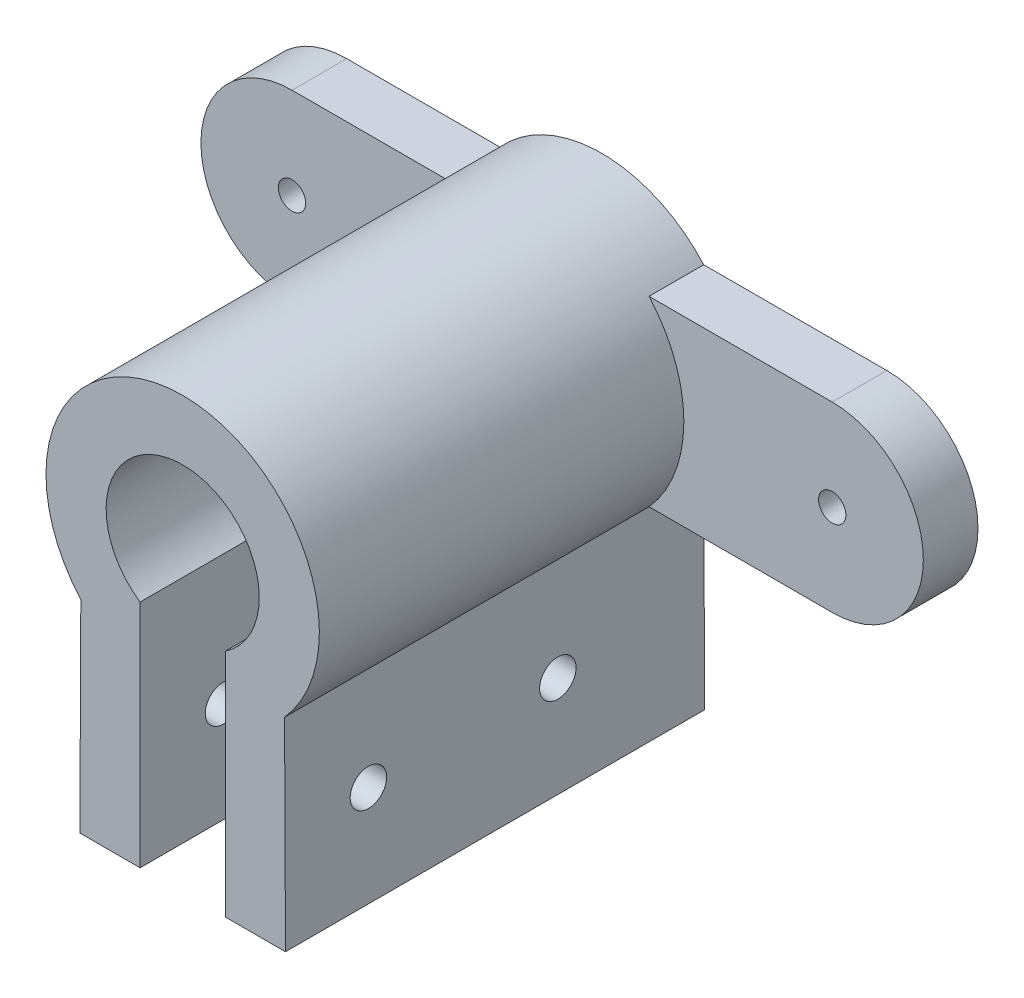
from build123d import *

# Parameters (mm, degrees)
SKETCH1_R                = 0.75
BOSS_EXTRUDE1_DEPTH      = 3
BOSS_EXTRUDE3_DEPTH      = 20
BOSS_EXTRUDE3_DEPTH_BACK = 3
SKETCH3_R                = 1
CUT_EXTRUDE1_DEPTH       = 20


with BuildPart() as part:
    # Sketch1 → Boss-Extrude1 (new body)
    with BuildSketch(Plane.XY):
        with BuildLine():
            Line((-7.130422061, -259.782156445), (-17.180252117, -259.782156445))
            ThreePointArc((-17.180252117, -259.782156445), (-22.770422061, -262.282156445), (-28.360592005, -259.782156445))
            Line((-28.360592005, -259.782156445), (-36.770422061, -259.782156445))
            ThreePointArc((-36.770422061, -259.782156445), (-41.770422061, -254.782156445), (-36.770422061, -249.782156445))
            Line((-36.770422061, -249.782156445), (-28.360592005, -249.782156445))
            ThreePointArc((-28.360592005, -249.782156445), (-22.770422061, -247.282156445), (-17.180252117, -249.782156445))
            Line((-17.180252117, -249.782156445), (-7.130422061, -249.782156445))
            ThreePointArc((-7.130422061, -249.782156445), (-2.130422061, -254.782156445), (-7.130422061, -259.782156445))
        make_face()
        with Locations((-7.130422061, -254.782156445)):
            Circle(SKETCH1_R, mode=Mode.SUBTRACT)
        with Locations((-36.770422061, -254.782156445)):
            Circle(SKETCH1_R, mode=Mode.SUBTRACT)
    extrude(amount=BOSS_EXTRUDE1_DEPTH)

    # Sketch2 → Boss-Extrude3 (add, two sides: drawn at the far end of the back side and taken through both)
    with BuildSketch(Plane.XY.offset(3).offset(-BOSS_EXTRUDE3_DEPTH_BACK)):
        with BuildLine():
            Line((-25.106595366, -261.909027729), (-25.106595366, -258.272470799))
            ThreePointArc((-25.106595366, -258.272470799), (-22.770422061, -250.582156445), (-20.434248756, -258.272470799))
            Line((-20.434248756, -258.272470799), (-20.434248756, -261.909027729))
            Line((-20.434248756, -261.909027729), (-20.434248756, -270.904107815))
            Line((-20.434248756, -270.904107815), (-17.129161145, -270.904107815))
            Line((-17.129161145, -270.904107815), (-17.180252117, -259.782156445))
            ThreePointArc((-17.180252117, -259.782156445), (-22.770422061, -247.282156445), (-28.360592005, -259.782156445))
            Line((-28.360592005, -259.782156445), (-28.411682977, -270.904107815))
            Line((-28.411682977, -270.904107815), (-25.106595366, -270.904107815))
            Line((-25.106595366, -270.904107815), (-25.106595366, -261.909027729))
        make_face()
    extrude(amount=BOSS_EXTRUDE3_DEPTH + BOSS_EXTRUDE3_DEPTH_BACK)

    # Sketch3 → Cut-Extrude1 (cut)
    with BuildSketch(Plane(origin=(-27.166655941, 0.124795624, 0), x_dir=(0, 0, 1), z_dir=(-0.9999894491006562, 0.004593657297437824, 0))):
        with Locations(Location((8.031425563, -265.470728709, 0), (0, 0, 270))):
            Circle(SKETCH3_R)
        with Locations(Location((18.425825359, -265.470728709, 0), (0, 0, 270))):
            Circle(SKETCH3_R)
    extrude(amount=-CUT_EXTRUDE1_DEPTH, mode=Mode.SUBTRACT)


solid = part.part
